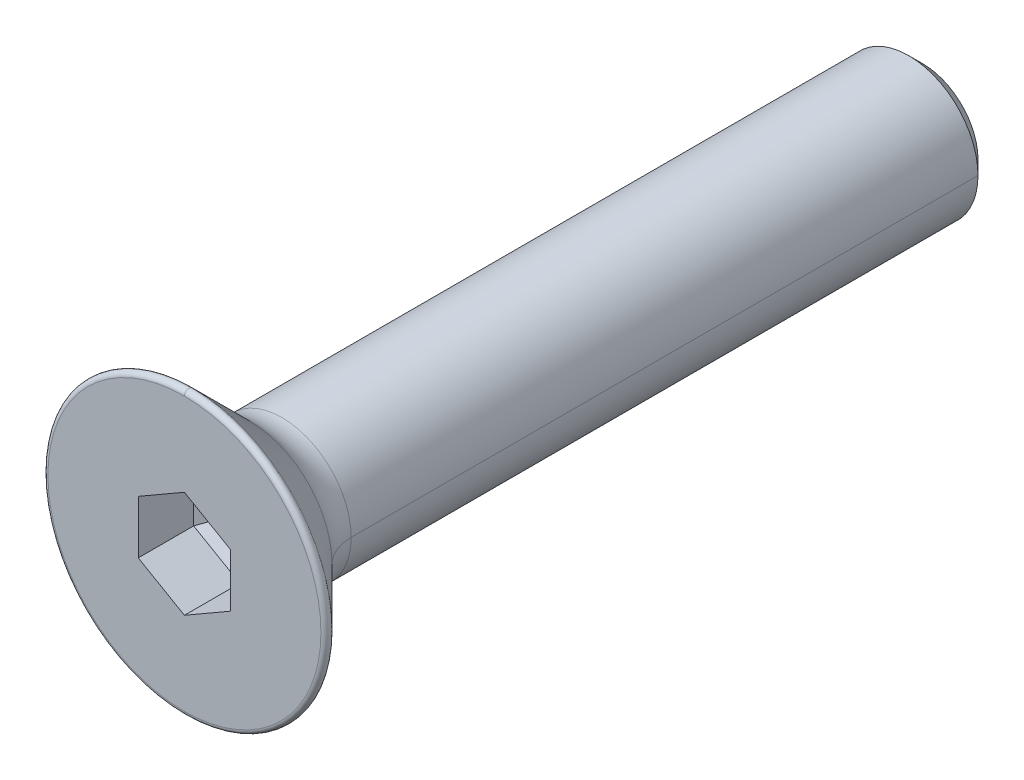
ISO-10303-21;
HEADER;
FILE_DESCRIPTION(('STEP AP214'),'2;1');
FILE_NAME('part.step','',(''),(''),'','','');
FILE_SCHEMA(('AUTOMOTIVE_DESIGN { 1 0 10303 214 1 1 1 1 }'));
ENDSEC;
DATA;
#1=APPLICATION_CONTEXT('core data for automotive mechanical design processes');
#2=APPLICATION_PROTOCOL_DEFINITION('international standard','automotive_design',2000,#1);
#3=PRODUCT_CONTEXT('',#1,'mechanical');
#4=PRODUCT('Part','Part','',(#3));
#5=PRODUCT_RELATED_PRODUCT_CATEGORY('part','',(#4));
#6=PRODUCT_DEFINITION_FORMATION('','',#4);
#7=PRODUCT_DEFINITION_CONTEXT('part definition',#1,'design');
#8=PRODUCT_DEFINITION('design','',#6,#7);
#9=PRODUCT_DEFINITION_SHAPE('','',#8);
#10=(LENGTH_UNIT() NAMED_UNIT(*) SI_UNIT(.MILLI.,.METRE.));
#11=(NAMED_UNIT(*) PLANE_ANGLE_UNIT() SI_UNIT($,.RADIAN.));
#12=(NAMED_UNIT(*) SI_UNIT($,.STERADIAN.) SOLID_ANGLE_UNIT());
#13=UNCERTAINTY_MEASURE_WITH_UNIT(LENGTH_MEASURE(1.E-05),#10,'distance_accuracy_value','');
#14=(GEOMETRIC_REPRESENTATION_CONTEXT(3) GLOBAL_UNCERTAINTY_ASSIGNED_CONTEXT((#13)) GLOBAL_UNIT_ASSIGNED_CONTEXT((#10,
#11,#12)) REPRESENTATION_CONTEXT('',''));
#15=CARTESIAN_POINT('',(0.,0.,0.));
#16=DIRECTION('',(0.,0.,1.));
#17=DIRECTION('',(1.,0.,0.));
#18=AXIS2_PLACEMENT_3D('',#15,#16,#17);
#19=CARTESIAN_POINT('',(0.,0.,0.));
#20=DIRECTION('',(0.,0.,1.));
#21=DIRECTION('',(1.,0.,0.));
#22=AXIS2_PLACEMENT_3D('',#19,#20,#21);
#23=CYLINDRICAL_SURFACE('',#22,1.5);
#24=DIRECTION('',(1.38384055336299E-07,-1.74377662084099E-11,1.));
#25=VECTOR('',#24,1.);
#26=CARTESIAN_POINT('',(1.499998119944,2.316278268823E-10,0.3000018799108));
#27=LINE('',#26,#25);
#28=CARTESIAN_POINT('',(1.5,0.,0.3000008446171));
#29=VERTEX_POINT('',#28);
#30=CARTESIAN_POINT('',(1.5,0.,13.88578643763));
#31=VERTEX_POINT('',#30);
#32=EDGE_CURVE('E179',#29,#31,#27,.T.);
#33=ORIENTED_EDGE('',*,*,#32,.F.);
#34=CARTESIAN_POINT('',(0.,0.,0.3000008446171));
#35=DIRECTION('',(0.,0.,-1.));
#36=DIRECTION('',(-1.,0.,0.));
#37=AXIS2_PLACEMENT_3D('',#34,#35,#36);
#38=CIRCLE('',#37,1.5);
#39=CARTESIAN_POINT('',(-1.5,0.,0.3000008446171));
#40=VERTEX_POINT('',#39);
#41=EDGE_CURVE('E186',#40,#29,#38,.T.);
#42=ORIENTED_EDGE('',*,*,#41,.F.);
#43=DIRECTION('',(-1.38384055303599E-07,1.73082893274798E-11,1.));
#44=VECTOR('',#43,1.);
#45=CARTESIAN_POINT('',(-1.499998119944,-2.316279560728E-10,0.3000018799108));
#46=LINE('',#45,#44);
#47=CARTESIAN_POINT('',(-1.5,0.,13.88578643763));
#48=VERTEX_POINT('',#47);
#49=EDGE_CURVE('E167',#40,#48,#46,.T.);
#50=ORIENTED_EDGE('',*,*,#49,.T.);
#51=CARTESIAN_POINT('',(0.,0.,13.88578643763));
#52=DIRECTION('',(0.,0.,-1.));
#53=DIRECTION('',(-1.,0.,0.));
#54=AXIS2_PLACEMENT_3D('',#51,#52,#53);
#55=CIRCLE('',#54,1.5);
#56=EDGE_CURVE('E249',#48,#31,#55,.T.);
#57=ORIENTED_EDGE('',*,*,#56,.T.);
#58=EDGE_LOOP('',(#33,#42,#50,#57));
#59=FACE_BOUND('',#58,.T.);
#60=ADVANCED_FACE('F16',(#59),#23,.T.);
#61=CARTESIAN_POINT('',(0.,0.,13.88578643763));
#62=DIRECTION('',(0.,0.,1.));
#63=DIRECTION('',(-0.0170853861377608,-0.999854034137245,0.));
#64=AXIS2_PLACEMENT_3D('',#61,#62,#63);
#65=TOROIDAL_SURFACE('',#64,2.5,1.);
#66=CARTESIAN_POINT('',(2.5,-2.879798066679E-10,13.88578643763));
#67=DIRECTION('',(1.151919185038E-10,1.,0.));
#68=DIRECTION('',(-1.,1.151919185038E-10,0.));
#69=AXIS2_PLACEMENT_3D('',#66,#67,#68);
#70=CIRCLE('',#69,1.);
#71=CARTESIAN_POINT('',(1.792893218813,0.,14.59289321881));
#72=VERTEX_POINT('',#71);
#73=EDGE_CURVE('E204',#31,#72,#70,.T.);
#74=ORIENTED_EDGE('',*,*,#73,.T.);
#75=CARTESIAN_POINT('',(0.,0.,14.59289321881));
#76=DIRECTION('',(0.,0.,1.));
#77=DIRECTION('',(0.,-1.,0.));
#78=AXIS2_PLACEMENT_3D('',#75,#76,#77);
#79=CIRCLE('',#78,1.792893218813);
#80=CARTESIAN_POINT('',(0.,-1.792893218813,14.59289321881));
#81=VERTEX_POINT('',#80);
#82=EDGE_CURVE('E10',#81,#72,#79,.T.);
#83=ORIENTED_EDGE('',*,*,#82,.F.);
#84=CARTESIAN_POINT('',(-2.28417507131E-10,-2.5,13.88578643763));
#85=DIRECTION('',(1.,-9.136700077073E-11,0.));
#86=DIRECTION('',(9.136700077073E-11,1.,0.));
#87=AXIS2_PLACEMENT_3D('',#84,#85,#86);
#88=CIRCLE('',#87,1.);
#89=CARTESIAN_POINT('',(0.,-1.5,13.88578643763));
#90=VERTEX_POINT('',#89);
#91=EDGE_CURVE('E244',#90,#81,#88,.T.);
#92=ORIENTED_EDGE('',*,*,#91,.F.);
#93=CARTESIAN_POINT('',(0.,0.,13.88578643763));
#94=DIRECTION('',(0.,0.,1.));
#95=DIRECTION('',(0.,-1.,0.));
#96=AXIS2_PLACEMENT_3D('',#93,#94,#95);
#97=CIRCLE('',#96,1.5);
#98=EDGE_CURVE('E216',#90,#31,#97,.T.);
#99=ORIENTED_EDGE('',*,*,#98,.T.);
#100=EDGE_LOOP('',(#74,#83,#92,#99));
#101=FACE_BOUND('',#100,.T.);
#102=ADVANCED_FACE('F392',(#101),#65,.F.);
#103=CARTESIAN_POINT('',(0.,0.,15.21109127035));
#104=DIRECTION('',(0.,0.,1.));
#105=DIRECTION('',(0.,1.,0.));
#106=AXIS2_PLACEMENT_3D('',#103,#104,#105);
#107=CONICAL_SURFACE('',#106,2.411091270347,0.7853981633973);
#108=DIRECTION('',(-2.74419146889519E-11,-0.707106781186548,0.707106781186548));
#109=VECTOR('',#108,1.);
#110=CARTESIAN_POINT('',(-1.160704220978E-12,-1.792893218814,14.59289321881));
#111=LINE('',#110,#109);
#112=CARTESIAN_POINT('',(0.,-3.029289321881,15.82928932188));
#113=VERTEX_POINT('',#112);
#114=EDGE_CURVE('E289',#81,#113,#111,.T.);
#115=ORIENTED_EDGE('',*,*,#114,.F.);
#116=ORIENTED_EDGE('',*,*,#82,.T.);
#117=CARTESIAN_POINT('',(0.,0.,14.59289321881));
#118=DIRECTION('',(0.,0.,1.));
#119=DIRECTION('',(1.,0.,0.));
#120=AXIS2_PLACEMENT_3D('',#117,#118,#119);
#121=CIRCLE('',#120,1.792893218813);
#122=CARTESIAN_POINT('',(0.,1.792893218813,14.59289321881));
#123=VERTEX_POINT('',#122);
#124=EDGE_CURVE('E340',#72,#123,#121,.T.);
#125=ORIENTED_EDGE('',*,*,#124,.T.);
#126=DIRECTION('',(2.76630039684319E-11,0.707106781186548,0.707106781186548));
#127=VECTOR('',#126,1.);
#128=CARTESIAN_POINT('',(7.737613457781E-13,1.792893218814,14.59289321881));
#129=LINE('',#128,#127);
#130=CARTESIAN_POINT('',(0.,3.029289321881,15.82928932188));
#131=VERTEX_POINT('',#130);
#132=EDGE_CURVE('E293',#123,#131,#129,.T.);
#133=ORIENTED_EDGE('',*,*,#132,.T.);
#134=CARTESIAN_POINT('',(0.,0.,15.82928932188));
#135=DIRECTION('',(0.,0.,1.));
#136=DIRECTION('',(0.,-1.,0.));
#137=AXIS2_PLACEMENT_3D('',#134,#135,#136);
#138=CIRCLE('',#137,3.029289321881);
#139=EDGE_CURVE('E27',#113,#131,#138,.T.);
#140=ORIENTED_EDGE('',*,*,#139,.F.);
#141=EDGE_LOOP('',(#115,#116,#125,#133,#140));
#142=FACE_BOUND('',#141,.T.);
#143=ADVANCED_FACE('F387',(#142),#107,.T.);
#144=CARTESIAN_POINT('',(0.,0.,15.9));
#145=DIRECTION('',(0.,0.,-1.));
#146=DIRECTION('',(-0.0160832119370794,-0.999870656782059,0.));
#147=AXIS2_PLACEMENT_3D('',#144,#145,#146);
#148=TOROIDAL_SURFACE('',#147,2.958578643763,0.1);
#149=CARTESIAN_POINT('',(0.,-2.958578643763,15.9));
#150=DIRECTION('',(1.,0.,0.));
#151=DIRECTION('',(0.,0.,1.));
#152=AXIS2_PLACEMENT_3D('',#149,#150,#151);
#153=CIRCLE('',#152,0.1);
#154=CARTESIAN_POINT('',(0.,-2.958578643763,16.));
#155=VERTEX_POINT('',#154);
#156=EDGE_CURVE('E223',#155,#113,#153,.T.);
#157=ORIENTED_EDGE('',*,*,#156,.T.);
#158=ORIENTED_EDGE('',*,*,#139,.T.);
#159=CARTESIAN_POINT('',(0.,2.958578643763,15.9));
#160=DIRECTION('',(-1.,0.,0.));
#161=DIRECTION('',(0.,0.,1.));
#162=AXIS2_PLACEMENT_3D('',#159,#160,#161);
#163=CIRCLE('',#162,0.1);
#164=CARTESIAN_POINT('',(0.,2.958578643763,16.));
#165=VERTEX_POINT('',#164);
#166=EDGE_CURVE('E220',#165,#131,#163,.T.);
#167=ORIENTED_EDGE('',*,*,#166,.F.);
#168=CARTESIAN_POINT('',(0.,0.,16.));
#169=DIRECTION('',(0.,0.,1.));
#170=DIRECTION('',(0.,-1.,0.));
#171=AXIS2_PLACEMENT_3D('',#168,#169,#170);
#172=CIRCLE('',#171,2.958578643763);
#173=EDGE_CURVE('E320',#155,#165,#172,.T.);
#174=ORIENTED_EDGE('',*,*,#173,.F.);
#175=EDGE_LOOP('',(#157,#158,#167,#174));
#176=FACE_BOUND('',#175,.T.);
#177=ADVANCED_FACE('F382',(#176),#148,.T.);
#178=CARTESIAN_POINT('',(0.,0.,14.2));
#179=DIRECTION('',(0.,0.,1.));
#180=DIRECTION('',(1.,0.,0.));
#181=AXIS2_PLACEMENT_3D('',#178,#179,#180);
#182=PLANE('',#181);
#183=DIRECTION('',(0.,1.,0.));
#184=VECTOR('',#183,1.);
#185=CARTESIAN_POINT('',(0.04330127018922,-0.025,14.2));
#186=LINE('',#185,#184);
#187=CARTESIAN_POINT('',(0.04330127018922,-0.025,14.2));
#188=VERTEX_POINT('',#187);
#189=CARTESIAN_POINT('',(0.04330127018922,0.025,14.2));
#190=VERTEX_POINT('',#189);
#191=EDGE_CURVE('E41',#188,#190,#186,.T.);
#192=ORIENTED_EDGE('',*,*,#191,.T.);
#193=DIRECTION('',(-0.866025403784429,0.500000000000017,0.));
#194=VECTOR('',#193,1.);
#195=CARTESIAN_POINT('',(0.04330127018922,0.025,14.2));
#196=LINE('',#195,#194);
#197=CARTESIAN_POINT('',(0.,0.05,14.2));
#198=VERTEX_POINT('',#197);
#199=EDGE_CURVE('E283',#190,#198,#196,.T.);
#200=ORIENTED_EDGE('',*,*,#199,.T.);
#201=DIRECTION('',(-0.866025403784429,-0.500000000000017,0.));
#202=VECTOR('',#201,1.);
#203=CARTESIAN_POINT('',(0.,0.05,14.2));
#204=LINE('',#203,#202);
#205=CARTESIAN_POINT('',(-0.04330127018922,0.025,14.2));
#206=VERTEX_POINT('',#205);
#207=EDGE_CURVE('E335',#198,#206,#204,.T.);
#208=ORIENTED_EDGE('',*,*,#207,.T.);
#209=DIRECTION('',(0.,-1.,0.));
#210=VECTOR('',#209,1.);
#211=CARTESIAN_POINT('',(-0.04330127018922,0.025,14.2));
#212=LINE('',#211,#210);
#213=CARTESIAN_POINT('',(-0.04330127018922,-0.025,14.2));
#214=VERTEX_POINT('',#213);
#215=EDGE_CURVE('E253',#206,#214,#212,.T.);
#216=ORIENTED_EDGE('',*,*,#215,.T.);
#217=DIRECTION('',(0.866025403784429,-0.500000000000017,0.));
#218=VECTOR('',#217,1.);
#219=CARTESIAN_POINT('',(-0.04330127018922,-0.025,14.2));
#220=LINE('',#219,#218);
#221=CARTESIAN_POINT('',(0.,-0.05,14.2));
#222=VERTEX_POINT('',#221);
#223=EDGE_CURVE('E114',#214,#222,#220,.T.);
#224=ORIENTED_EDGE('',*,*,#223,.T.);
#225=DIRECTION('',(0.866025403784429,0.500000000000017,0.));
#226=VECTOR('',#225,1.);
#227=CARTESIAN_POINT('',(0.,-0.05,14.2));
#228=LINE('',#227,#226);
#229=EDGE_CURVE('E230',#222,#188,#228,.T.);
#230=ORIENTED_EDGE('',*,*,#229,.T.);
#231=EDGE_LOOP('',(#192,#200,#208,#216,#224,#230));
#232=FACE_BOUND('',#231,.T.);
#233=ADVANCED_FACE('F413',(#232),#182,.T.);
#234=CARTESIAN_POINT('',(1.,-0.5773502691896,16.));
#235=DIRECTION('',(1.,0.,0.));
#236=DIRECTION('',(0.,1.,0.));
#237=AXIS2_PLACEMENT_3D('',#234,#235,#236);
#238=PLANE('',#237);
#239=DIRECTION('',(0.,0.,-1.));
#240=VECTOR('',#239,1.);
#241=CARTESIAN_POINT('',(1.,-0.5773502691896,16.));
#242=LINE('',#241,#240);
#243=CARTESIAN_POINT('',(1.,-0.5773502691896,16.));
#244=VERTEX_POINT('',#243);
#245=CARTESIAN_POINT('',(1.,-0.5773502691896,14.8));
#246=VERTEX_POINT('',#245);
#247=EDGE_CURVE('E304',#244,#246,#242,.T.);
#248=ORIENTED_EDGE('',*,*,#247,.F.);
#249=DIRECTION('',(0.,1.,0.));
#250=VECTOR('',#249,1.);
#251=CARTESIAN_POINT('',(1.,-0.5773502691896,16.));
#252=LINE('',#251,#250);
#253=CARTESIAN_POINT('',(1.,0.5773502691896,16.));
#254=VERTEX_POINT('',#253);
#255=EDGE_CURVE('E225',#244,#254,#252,.T.);
#256=ORIENTED_EDGE('',*,*,#255,.T.);
#257=DIRECTION('',(0.,0.,-1.));
#258=VECTOR('',#257,1.);
#259=CARTESIAN_POINT('',(1.,0.5773502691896,16.));
#260=LINE('',#259,#258);
#261=CARTESIAN_POINT('',(1.,0.5773502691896,14.8));
#262=VERTEX_POINT('',#261);
#263=EDGE_CURVE('E265',#254,#262,#260,.T.);
#264=ORIENTED_EDGE('',*,*,#263,.T.);
#265=DIRECTION('',(0.,1.,0.));
#266=VECTOR('',#265,1.);
#267=CARTESIAN_POINT('',(1.,-0.5773502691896,14.8));
#268=LINE('',#267,#266);
#269=EDGE_CURVE('E20',#246,#262,#268,.T.);
#270=ORIENTED_EDGE('',*,*,#269,.F.);
#271=EDGE_LOOP('',(#248,#256,#264,#270));
#272=FACE_BOUND('',#271,.T.);
#273=ADVANCED_FACE('F18',(#272),#238,.F.);
#274=CARTESIAN_POINT('',(0.5216506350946,0.,14.5));
#275=DIRECTION('',(0.531312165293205,0.,-0.847176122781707));
#276=DIRECTION('',(0.,-1.,0.));
#277=AXIS2_PLACEMENT_3D('',#274,#275,#276);
#278=PLANE('',#277);
#279=DIRECTION('',(0.761021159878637,0.439375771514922,0.477279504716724));
#280=VECTOR('',#279,1.);
#281=CARTESIAN_POINT('',(0.04330127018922,0.025,14.2));
#282=LINE('',#281,#280);
#283=EDGE_CURVE('E279',#190,#262,#282,.T.);
#284=ORIENTED_EDGE('',*,*,#283,.F.);
#285=ORIENTED_EDGE('',*,*,#191,.F.);
#286=DIRECTION('',(0.761021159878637,-0.439375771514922,0.477279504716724));
#287=VECTOR('',#286,1.);
#288=CARTESIAN_POINT('',(0.04330127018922,-0.025,14.2));
#289=LINE('',#288,#287);
#290=EDGE_CURVE('E234',#188,#246,#289,.T.);
#291=ORIENTED_EDGE('',*,*,#290,.T.);
#292=ORIENTED_EDGE('',*,*,#269,.T.);
#293=EDGE_LOOP('',(#284,#285,#291,#292));
#294=FACE_BOUND('',#293,.T.);
#295=ADVANCED_FACE('F425',(#294),#278,.F.);
#296=CARTESIAN_POINT('',(0.2608253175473,0.4517627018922,14.5));
#297=DIRECTION('',(0.265656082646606,0.46012983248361,-0.847176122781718));
#298=DIRECTION('',(-0.954186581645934,0.,-0.299212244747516));
#299=AXIS2_PLACEMENT_3D('',#296,#297,#298);
#300=PLANE('',#299);
#301=DIRECTION('',(0.,0.878751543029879,0.477279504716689));
#302=VECTOR('',#301,1.);
#303=CARTESIAN_POINT('',(0.,0.05,14.2));
#304=LINE('',#303,#302);
#305=CARTESIAN_POINT('',(0.,1.154700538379,14.8));
#306=VERTEX_POINT('',#305);
#307=EDGE_CURVE('E328',#198,#306,#304,.T.);
#308=ORIENTED_EDGE('',*,*,#307,.F.);
#309=ORIENTED_EDGE('',*,*,#199,.F.);
#310=ORIENTED_EDGE('',*,*,#283,.T.);
#311=DIRECTION('',(-0.866025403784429,0.500000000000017,0.));
#312=VECTOR('',#311,1.);
#313=CARTESIAN_POINT('',(1.,0.5773502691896,14.8));
#314=LINE('',#313,#312);
#315=EDGE_CURVE('E324',#262,#306,#314,.T.);
#316=ORIENTED_EDGE('',*,*,#315,.T.);
#317=EDGE_LOOP('',(#308,#309,#310,#316));
#318=FACE_BOUND('',#317,.T.);
#319=ADVANCED_FACE('F422',(#318),#300,.F.);
#320=CARTESIAN_POINT('',(1.,0.5773502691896,16.));
#321=DIRECTION('',(0.500000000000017,0.866025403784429,0.));
#322=DIRECTION('',(0.,0.,-1.));
#323=AXIS2_PLACEMENT_3D('',#320,#321,#322);
#324=PLANE('',#323);
#325=ORIENTED_EDGE('',*,*,#263,.F.);
#326=DIRECTION('',(-0.866025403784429,0.500000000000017,0.));
#327=VECTOR('',#326,1.);
#328=CARTESIAN_POINT('',(1.,0.5773502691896,16.));
#329=LINE('',#328,#327);
#330=CARTESIAN_POINT('',(0.,1.154700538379,16.));
#331=VERTEX_POINT('',#330);
#332=EDGE_CURVE('E208',#254,#331,#329,.T.);
#333=ORIENTED_EDGE('',*,*,#332,.T.);
#334=DIRECTION('',(0.,0.,-1.));
#335=VECTOR('',#334,1.);
#336=CARTESIAN_POINT('',(0.,1.154700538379,16.));
#337=LINE('',#336,#335);
#338=EDGE_CURVE('E261',#331,#306,#337,.T.);
#339=ORIENTED_EDGE('',*,*,#338,.T.);
#340=ORIENTED_EDGE('',*,*,#315,.F.);
#341=EDGE_LOOP('',(#325,#333,#339,#340));
#342=FACE_BOUND('',#341,.T.);
#343=ADVANCED_FACE('F424',(#342),#324,.F.);
#344=CARTESIAN_POINT('',(0.,1.154700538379,16.));
#345=DIRECTION('',(-0.500000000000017,0.866025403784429,0.));
#346=DIRECTION('',(0.,0.,1.));
#347=AXIS2_PLACEMENT_3D('',#344,#345,#346);
#348=PLANE('',#347);
#349=ORIENTED_EDGE('',*,*,#338,.F.);
#350=DIRECTION('',(-0.866025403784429,-0.500000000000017,0.));
#351=VECTOR('',#350,1.);
#352=CARTESIAN_POINT('',(0.,1.154700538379,16.));
#353=LINE('',#352,#351);
#354=CARTESIAN_POINT('',(-1.,0.5773502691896,16.));
#355=VERTEX_POINT('',#354);
#356=EDGE_CURVE('E205',#331,#355,#353,.T.);
#357=ORIENTED_EDGE('',*,*,#356,.T.);
#358=DIRECTION('',(0.,0.,-1.));
#359=VECTOR('',#358,1.);
#360=CARTESIAN_POINT('',(-1.,0.5773502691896,16.));
#361=LINE('',#360,#359);
#362=CARTESIAN_POINT('',(-1.,0.5773502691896,14.8));
#363=VERTEX_POINT('',#362);
#364=EDGE_CURVE('E254',#355,#363,#361,.T.);
#365=ORIENTED_EDGE('',*,*,#364,.T.);
#366=DIRECTION('',(-0.866025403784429,-0.500000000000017,0.));
#367=VECTOR('',#366,1.);
#368=CARTESIAN_POINT('',(0.,1.154700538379,14.8));
#369=LINE('',#368,#367);
#370=EDGE_CURVE('E266',#306,#363,#369,.T.);
#371=ORIENTED_EDGE('',*,*,#370,.F.);
#372=EDGE_LOOP('',(#349,#357,#365,#371));
#373=FACE_BOUND('',#372,.T.);
#374=ADVANCED_FACE('F431',(#373),#348,.F.);
#375=CARTESIAN_POINT('',(-0.2608253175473,0.4517627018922,14.5));
#376=DIRECTION('',(-0.265656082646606,0.46012983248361,-0.847176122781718));
#377=DIRECTION('',(-0.954186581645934,0.,0.299212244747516));
#378=AXIS2_PLACEMENT_3D('',#375,#376,#377);
#379=PLANE('',#378);
#380=DIRECTION('',(-0.761021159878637,0.439375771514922,0.477279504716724));
#381=VECTOR('',#380,1.);
#382=CARTESIAN_POINT('',(-0.04330127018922,0.025,14.2));
#383=LINE('',#382,#381);
#384=EDGE_CURVE('E274',#206,#363,#383,.T.);
#385=ORIENTED_EDGE('',*,*,#384,.F.);
#386=ORIENTED_EDGE('',*,*,#207,.F.);
#387=ORIENTED_EDGE('',*,*,#307,.T.);
#388=ORIENTED_EDGE('',*,*,#370,.T.);
#389=EDGE_LOOP('',(#385,#386,#387,#388));
#390=FACE_BOUND('',#389,.T.);
#391=ADVANCED_FACE('F439',(#390),#379,.F.);
#392=CARTESIAN_POINT('',(-0.5216506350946,0.,14.5));
#393=DIRECTION('',(-0.531312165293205,0.,-0.847176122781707));
#394=DIRECTION('',(-0.847176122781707,0.,0.531312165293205));
#395=AXIS2_PLACEMENT_3D('',#392,#393,#394);
#396=PLANE('',#395);
#397=DIRECTION('',(-0.761021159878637,-0.439375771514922,0.477279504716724));
#398=VECTOR('',#397,1.);
#399=CARTESIAN_POINT('',(-0.04330127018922,-0.025,14.2));
#400=LINE('',#399,#398);
#401=CARTESIAN_POINT('',(-1.,-0.5773502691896,14.8));
#402=VERTEX_POINT('',#401);
#403=EDGE_CURVE('E243',#214,#402,#400,.T.);
#404=ORIENTED_EDGE('',*,*,#403,.F.);
#405=ORIENTED_EDGE('',*,*,#215,.F.);
#406=ORIENTED_EDGE('',*,*,#384,.T.);
#407=DIRECTION('',(0.,-1.,0.));
#408=VECTOR('',#407,1.);
#409=CARTESIAN_POINT('',(-1.,0.5773502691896,14.8));
#410=LINE('',#409,#408);
#411=EDGE_CURVE('E250',#363,#402,#410,.T.);
#412=ORIENTED_EDGE('',*,*,#411,.T.);
#413=EDGE_LOOP('',(#404,#405,#406,#412));
#414=FACE_BOUND('',#413,.T.);
#415=ADVANCED_FACE('F442',(#414),#396,.F.);
#416=CARTESIAN_POINT('',(-1.,0.5773502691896,16.));
#417=DIRECTION('',(-1.,0.,0.));
#418=DIRECTION('',(0.,0.,1.));
#419=AXIS2_PLACEMENT_3D('',#416,#417,#418);
#420=PLANE('',#419);
#421=ORIENTED_EDGE('',*,*,#364,.F.);
#422=DIRECTION('',(0.,-1.,0.));
#423=VECTOR('',#422,1.);
#424=CARTESIAN_POINT('',(-1.,0.5773502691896,16.));
#425=LINE('',#424,#423);
#426=CARTESIAN_POINT('',(-1.,-0.5773502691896,16.));
#427=VERTEX_POINT('',#426);
#428=EDGE_CURVE('E209',#355,#427,#425,.T.);
#429=ORIENTED_EDGE('',*,*,#428,.T.);
#430=DIRECTION('',(0.,0.,-1.));
#431=VECTOR('',#430,1.);
#432=CARTESIAN_POINT('',(-1.,-0.5773502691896,16.));
#433=LINE('',#432,#431);
#434=EDGE_CURVE('E242',#427,#402,#433,.T.);
#435=ORIENTED_EDGE('',*,*,#434,.T.);
#436=ORIENTED_EDGE('',*,*,#411,.F.);
#437=EDGE_LOOP('',(#421,#429,#435,#436));
#438=FACE_BOUND('',#437,.T.);
#439=ADVANCED_FACE('F452',(#438),#420,.F.);
#440=CARTESIAN_POINT('',(-1.,-0.5773502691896,16.));
#441=DIRECTION('',(-0.500000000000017,-0.866025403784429,0.));
#442=DIRECTION('',(-0.866025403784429,0.500000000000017,0.));
#443=AXIS2_PLACEMENT_3D('',#440,#441,#442);
#444=PLANE('',#443);
#445=ORIENTED_EDGE('',*,*,#434,.F.);
#446=DIRECTION('',(0.866025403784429,-0.500000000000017,0.));
#447=VECTOR('',#446,1.);
#448=CARTESIAN_POINT('',(-1.,-0.5773502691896,16.));
#449=LINE('',#448,#447);
#450=CARTESIAN_POINT('',(0.,-1.154700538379,16.));
#451=VERTEX_POINT('',#450);
#452=EDGE_CURVE('E212',#427,#451,#449,.T.);
#453=ORIENTED_EDGE('',*,*,#452,.T.);
#454=DIRECTION('',(0.,0.,-1.));
#455=VECTOR('',#454,1.);
#456=CARTESIAN_POINT('',(0.,-1.154700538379,16.));
#457=LINE('',#456,#455);
#458=CARTESIAN_POINT('',(0.,-1.154700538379,14.8));
#459=VERTEX_POINT('',#458);
#460=EDGE_CURVE('E300',#451,#459,#457,.T.);
#461=ORIENTED_EDGE('',*,*,#460,.T.);
#462=DIRECTION('',(0.866025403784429,-0.500000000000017,0.));
#463=VECTOR('',#462,1.);
#464=CARTESIAN_POINT('',(-1.,-0.5773502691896,14.8));
#465=LINE('',#464,#463);
#466=EDGE_CURVE('E238',#402,#459,#465,.T.);
#467=ORIENTED_EDGE('',*,*,#466,.F.);
#468=EDGE_LOOP('',(#445,#453,#461,#467));
#469=FACE_BOUND('',#468,.T.);
#470=ADVANCED_FACE('F455',(#469),#444,.F.);
#471=CARTESIAN_POINT('',(-0.2608253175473,-0.4517627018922,14.5));
#472=DIRECTION('',(-0.265656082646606,-0.46012983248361,-0.847176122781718));
#473=DIRECTION('',(0.,-0.878751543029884,0.477279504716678));
#474=AXIS2_PLACEMENT_3D('',#471,#472,#473);
#475=PLANE('',#474);
#476=DIRECTION('',(0.,-0.878751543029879,0.477279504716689));
#477=VECTOR('',#476,1.);
#478=CARTESIAN_POINT('',(0.,-0.05,14.2));
#479=LINE('',#478,#477);
#480=EDGE_CURVE('E233',#222,#459,#479,.T.);
#481=ORIENTED_EDGE('',*,*,#480,.F.);
#482=ORIENTED_EDGE('',*,*,#223,.F.);
#483=ORIENTED_EDGE('',*,*,#403,.T.);
#484=ORIENTED_EDGE('',*,*,#466,.T.);
#485=EDGE_LOOP('',(#481,#482,#483,#484));
#486=FACE_BOUND('',#485,.T.);
#487=ADVANCED_FACE('F461',(#486),#475,.F.);
#488=CARTESIAN_POINT('',(0.2608253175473,-0.4517627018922,14.5));
#489=DIRECTION('',(0.265656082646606,-0.46012983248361,-0.847176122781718));
#490=DIRECTION('',(0.,-0.878751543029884,0.477279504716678));
#491=AXIS2_PLACEMENT_3D('',#488,#489,#490);
#492=PLANE('',#491);
#493=ORIENTED_EDGE('',*,*,#290,.F.);
#494=ORIENTED_EDGE('',*,*,#229,.F.);
#495=ORIENTED_EDGE('',*,*,#480,.T.);
#496=DIRECTION('',(0.866025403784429,0.500000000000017,0.));
#497=VECTOR('',#496,1.);
#498=CARTESIAN_POINT('',(0.,-1.154700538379,14.8));
#499=LINE('',#498,#497);
#500=EDGE_CURVE('E308',#459,#246,#499,.T.);
#501=ORIENTED_EDGE('',*,*,#500,.T.);
#502=EDGE_LOOP('',(#493,#494,#495,#501));
#503=FACE_BOUND('',#502,.T.);
#504=ADVANCED_FACE('F465',(#503),#492,.F.);
#505=CARTESIAN_POINT('',(0.,-1.154700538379,16.));
#506=DIRECTION('',(0.500000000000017,-0.866025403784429,0.));
#507=DIRECTION('',(0.,0.,-1.));
#508=AXIS2_PLACEMENT_3D('',#505,#506,#507);
#509=PLANE('',#508);
#510=ORIENTED_EDGE('',*,*,#460,.F.);
#511=DIRECTION('',(0.866025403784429,0.500000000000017,0.));
#512=VECTOR('',#511,1.);
#513=CARTESIAN_POINT('',(0.,-1.154700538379,16.));
#514=LINE('',#513,#512);
#515=EDGE_CURVE('E228',#451,#244,#514,.T.);
#516=ORIENTED_EDGE('',*,*,#515,.T.);
#517=ORIENTED_EDGE('',*,*,#247,.T.);
#518=ORIENTED_EDGE('',*,*,#500,.F.);
#519=EDGE_LOOP('',(#510,#516,#517,#518));
#520=FACE_BOUND('',#519,.T.);
#521=ADVANCED_FACE('F548',(#520),#509,.F.);
#522=CARTESIAN_POINT('',(0.,0.,16.));
#523=DIRECTION('',(0.,0.,-1.));
#524=DIRECTION('',(0.,-1.,0.));
#525=AXIS2_PLACEMENT_3D('',#522,#523,#524);
#526=PLANE('',#525);
#527=ORIENTED_EDGE('',*,*,#452,.F.);
#528=ORIENTED_EDGE('',*,*,#428,.F.);
#529=ORIENTED_EDGE('',*,*,#356,.F.);
#530=ORIENTED_EDGE('',*,*,#332,.F.);
#531=ORIENTED_EDGE('',*,*,#255,.F.);
#532=ORIENTED_EDGE('',*,*,#515,.F.);
#533=EDGE_LOOP('',(#527,#528,#529,#530,#531,#532));
#534=FACE_BOUND('',#533,.T.);
#535=CARTESIAN_POINT('',(0.,0.,16.));
#536=DIRECTION('',(0.,0.,1.));
#537=DIRECTION('',(0.,1.,0.));
#538=AXIS2_PLACEMENT_3D('',#535,#536,#537);
#539=CIRCLE('',#538,2.958578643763);
#540=EDGE_CURVE('E269',#165,#155,#539,.T.);
#541=ORIENTED_EDGE('',*,*,#540,.T.);
#542=ORIENTED_EDGE('',*,*,#173,.T.);
#543=EDGE_LOOP('',(#541,#542));
#544=FACE_BOUND('',#543,.T.);
#545=ADVANCED_FACE('F374',(#534,#544),#526,.F.);
#546=CARTESIAN_POINT('',(0.,0.,15.9));
#547=DIRECTION('',(0.,0.,-1.));
#548=DIRECTION('',(0.0160832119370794,0.999870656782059,0.));
#549=AXIS2_PLACEMENT_3D('',#546,#547,#548);
#550=TOROIDAL_SURFACE('',#549,2.958578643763,0.1);
#551=ORIENTED_EDGE('',*,*,#166,.T.);
#552=CARTESIAN_POINT('',(0.,0.,15.82928932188));
#553=DIRECTION('',(0.,0.,1.));
#554=DIRECTION('',(0.,1.,0.));
#555=AXIS2_PLACEMENT_3D('',#552,#553,#554);
#556=CIRCLE('',#555,3.029289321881);
#557=EDGE_CURVE('E224',#131,#113,#556,.T.);
#558=ORIENTED_EDGE('',*,*,#557,.T.);
#559=ORIENTED_EDGE('',*,*,#156,.F.);
#560=ORIENTED_EDGE('',*,*,#540,.F.);
#561=EDGE_LOOP('',(#551,#558,#559,#560));
#562=FACE_BOUND('',#561,.T.);
#563=ADVANCED_FACE('F380',(#562),#550,.T.);
#564=CARTESIAN_POINT('',(0.,0.,15.21109127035));
#565=DIRECTION('',(0.,0.,1.));
#566=DIRECTION('',(0.,1.,0.));
#567=AXIS2_PLACEMENT_3D('',#564,#565,#566);
#568=CONICAL_SURFACE('',#567,2.411091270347,0.7853981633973);
#569=ORIENTED_EDGE('',*,*,#132,.F.);
#570=CARTESIAN_POINT('',(0.,0.,14.59289321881));
#571=DIRECTION('',(0.,0.,1.));
#572=DIRECTION('',(0.,1.,0.));
#573=AXIS2_PLACEMENT_3D('',#570,#571,#572);
#574=CIRCLE('',#573,1.792893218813);
#575=EDGE_CURVE('E248',#123,#81,#574,.T.);
#576=ORIENTED_EDGE('',*,*,#575,.T.);
#577=ORIENTED_EDGE('',*,*,#114,.T.);
#578=ORIENTED_EDGE('',*,*,#557,.F.);
#579=EDGE_LOOP('',(#569,#576,#577,#578));
#580=FACE_BOUND('',#579,.T.);
#581=ADVANCED_FACE('F384',(#580),#568,.T.);
#582=CARTESIAN_POINT('',(0.,0.,13.88578643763));
#583=DIRECTION('',(0.,0.,1.));
#584=DIRECTION('',(0.0170853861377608,0.999854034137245,0.));
#585=AXIS2_PLACEMENT_3D('',#582,#583,#584);
#586=TOROIDAL_SURFACE('',#585,2.5,1.);
#587=ORIENTED_EDGE('',*,*,#124,.F.);
#588=ORIENTED_EDGE('',*,*,#73,.F.);
#589=ORIENTED_EDGE('',*,*,#56,.F.);
#590=CARTESIAN_POINT('',(0.,0.,13.88578643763));
#591=DIRECTION('',(0.,0.,1.));
#592=DIRECTION('',(-1.,0.,0.));
#593=AXIS2_PLACEMENT_3D('',#590,#591,#592);
#594=CIRCLE('',#593,1.5);
#595=EDGE_CURVE('E174',#48,#90,#594,.T.);
#596=ORIENTED_EDGE('',*,*,#595,.T.);
#597=ORIENTED_EDGE('',*,*,#91,.T.);
#598=ORIENTED_EDGE('',*,*,#575,.F.);
#599=EDGE_LOOP('',(#587,#588,#589,#596,#597,#598));
#600=FACE_BOUND('',#599,.T.);
#601=ADVANCED_FACE('F391',(#600),#586,.F.);
#602=CARTESIAN_POINT('',(0.,0.,0.));
#603=DIRECTION('',(0.,0.,1.));
#604=DIRECTION('',(1.,0.,0.));
#605=AXIS2_PLACEMENT_3D('',#602,#603,#604);
#606=CYLINDRICAL_SURFACE('',#605,1.5);
#607=ORIENTED_EDGE('',*,*,#49,.F.);
#608=CARTESIAN_POINT('',(0.,0.,0.3000008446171));
#609=DIRECTION('',(0.,0.,-1.));
#610=DIRECTION('',(1.,0.,0.));
#611=AXIS2_PLACEMENT_3D('',#608,#609,#610);
#612=CIRCLE('',#611,1.5);
#613=EDGE_CURVE('E170',#29,#40,#612,.T.);
#614=ORIENTED_EDGE('',*,*,#613,.F.);
#615=ORIENTED_EDGE('',*,*,#32,.T.);
#616=ORIENTED_EDGE('',*,*,#98,.F.);
#617=ORIENTED_EDGE('',*,*,#595,.F.);
#618=EDGE_LOOP('',(#607,#614,#615,#616,#617));
#619=FACE_BOUND('',#618,.T.);
#620=ADVANCED_FACE('F168',(#619),#606,.T.);
#621=CARTESIAN_POINT('',(0.,0.,0.1500037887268));
#622=DIRECTION('',(0.,0.,1.));
#623=DIRECTION('',(0.,-1.,0.));
#624=AXIS2_PLACEMENT_3D('',#621,#622,#623);
#625=CONICAL_SURFACE('',#624,1.349997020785,0.78539565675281);
#626=DIRECTION('',(0.707107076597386,-3.63975928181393E-11,0.707106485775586));
#627=VECTOR('',#626,1.);
#628=CARTESIAN_POINT('',(1.199997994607,2.470700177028E-10,2.005238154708E-06));
#629=LINE('',#628,#627);
#630=CARTESIAN_POINT('',(1.19999665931,0.,2.675255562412E-06));
#631=VERTEX_POINT('',#630);
#632=EDGE_CURVE('E182',#631,#29,#629,.T.);
#633=ORIENTED_EDGE('',*,*,#632,.T.);
#634=ORIENTED_EDGE('',*,*,#613,.T.);
#635=DIRECTION('',(-0.707107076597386,3.63971205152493E-11,0.707106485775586));
#636=VECTOR('',#635,1.);
#637=CARTESIAN_POINT('',(-1.199997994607,-2.470699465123E-10,2.005238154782E-06));
#638=LINE('',#637,#636);
#639=CARTESIAN_POINT('',(-1.19999665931,0.,2.675255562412E-06));
#640=VERTEX_POINT('',#639);
#641=EDGE_CURVE('E158',#640,#40,#638,.T.);
#642=ORIENTED_EDGE('',*,*,#641,.F.);
#643=CARTESIAN_POINT('',(0.,0.,2.67525556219E-06));
#644=DIRECTION('',(0.,0.,-1.));
#645=DIRECTION('',(1.,0.,0.));
#646=AXIS2_PLACEMENT_3D('',#643,#644,#645);
#647=CIRCLE('',#646,1.19999665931);
#648=EDGE_CURVE('E200',#631,#640,#647,.T.);
#649=ORIENTED_EDGE('',*,*,#648,.F.);
#650=EDGE_LOOP('',(#633,#634,#642,#649));
#651=FACE_BOUND('',#650,.T.);
#652=ADVANCED_FACE('F181',(#651),#625,.T.);
#653=CARTESIAN_POINT('',(0.,0.,0.1500037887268));
#654=DIRECTION('',(0.,0.,1.));
#655=DIRECTION('',(0.,-1.,0.));
#656=AXIS2_PLACEMENT_3D('',#653,#654,#655);
#657=CONICAL_SURFACE('',#656,1.349997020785,0.78539565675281);
#658=ORIENTED_EDGE('',*,*,#641,.T.);
#659=ORIENTED_EDGE('',*,*,#41,.T.);
#660=ORIENTED_EDGE('',*,*,#632,.F.);
#661=CARTESIAN_POINT('',(0.,0.,2.675255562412E-06));
#662=DIRECTION('',(0.,0.,-1.));
#663=DIRECTION('',(-1.,0.,0.));
#664=AXIS2_PLACEMENT_3D('',#661,#662,#663);
#665=CIRCLE('',#664,1.19999665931);
#666=EDGE_CURVE('E192',#640,#631,#665,.T.);
#667=ORIENTED_EDGE('',*,*,#666,.F.);
#668=EDGE_LOOP('',(#658,#659,#660,#667));
#669=FACE_BOUND('',#668,.T.);
#670=ADVANCED_FACE('F190',(#669),#657,.T.);
#671=CARTESIAN_POINT('',(0.,0.,0.));
#672=DIRECTION('',(0.,0.,1.));
#673=DIRECTION('',(1.,0.,0.));
#674=AXIS2_PLACEMENT_3D('',#671,#672,#673);
#675=PLANE('',#674);
#676=ORIENTED_EDGE('',*,*,#648,.T.);
#677=ORIENTED_EDGE('',*,*,#666,.T.);
#678=EDGE_LOOP('',(#676,#677));
#679=FACE_BOUND('',#678,.T.);
#680=ADVANCED_FACE('F415',(#679),#675,.F.);
#681=CLOSED_SHELL('',(#60,#102,#143,#177,#233,#273,#295,#319,#343,#374,#391,#415,#439,#470,#487,
#504,#521,#545,#563,#581,#601,#620,#652,#670,#680));
#682=MANIFOLD_SOLID_BREP('B1',#681);
#683=ADVANCED_BREP_SHAPE_REPRESENTATION('',(#18,#682),#14);
#684=SHAPE_DEFINITION_REPRESENTATION(#9,#683);
ENDSEC;
END-ISO-10303-21;
